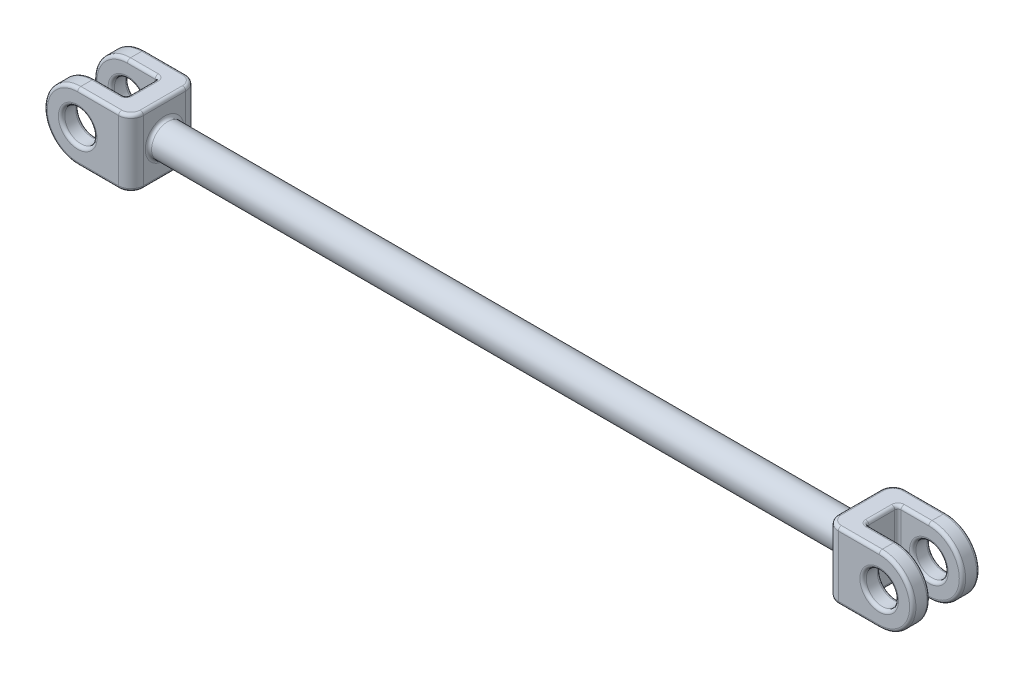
from build123d import *

# Parameters (mm, degrees)
SKETCH1_R          = 4.1275
EXTRUDE1_DEPTH     = 8.5852
SKETCH4_W          = 16.51
SKETCH4_H          = 8.255
CUT_EXTRUDE2_DEPTH = 24.549361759
SKETCH8_R          = 4.1275
EXTRUDE3_DEPTH     = 88.9
FILLET5_R          = 3.175
FILLET6_R          = 0.8128


with BuildPart() as part:
    # Sketch1 → Extrude1 (new, symmetric)
    with BuildSketch(Plane.XY):
        with BuildLine():
            Line((0, -8.5852), (13.6398, -8.5852))
            Line((13.6398, -8.5852), (13.6398, 8.5852))
            Line((13.6398, 8.5852), (0, 8.5852))
            ThreePointArc((0, 8.5852), (-8.5852, 0), (0, -8.5852))
        make_face()
        Circle(SKETCH1_R, mode=Mode.SUBTRACT)
    extrude(amount=EXTRUDE1_DEPTH, both=True)

    # Sketch4 → Cut-Extrude2 (cut, through all)
    with BuildSketch(Plane(origin=(0, 8.5852, 0), x_dir=(-1, 0, 0), z_dir=(0, 1, 0))):
        with Locations((0.3302, 0)):
            Rectangle(SKETCH4_W, SKETCH4_H)
    extrude(amount=-CUT_EXTRUDE2_DEPTH, mode=Mode.SUBTRACT)

    # Sketch8 → Extrude3 (add)
    with BuildSketch(Plane(origin=(13.6398, 0, 0), x_dir=(0, 0, -1), z_dir=(1, 0, 0))):
        with Locations(Location((0, 0, 0), (0, 0, 180))):
            Circle(SKETCH8_R)
    extrude(amount=EXTRUDE3_DEPTH)

    # Mirror1: part across plane


with BuildPart() as part_1:
    add(part.part)
    add(part.part.mirror(Plane(origin=(102.5398, 0, 0), x_dir=(0, 0, 1), z_dir=(1, 0, 0))))

    # Fillet5
    fillet5_edges = [part_1.edges().sort_by_distance(p)[0] for p in [
        (13.6398, 0, 8.5852),
        (13.6398, 0, -8.5852),
        (191.4398, 0, 8.5852),
        (191.4398, 0, -8.5852),
    ]]
    fillet(fillet5_edges, radius=FILLET5_R)

    # Fillet6
    fillet6_edges = [part_1.edges().sort_by_distance(p)[0] for p in [
        (-4.1275, 0, -8.5852),
        (-4.1275, 0, 8.5852),
        (3.9624, 8.5852, 4.1275),
        (7.9248, 8.5852, 0),
        (3.9624, 8.5852, -4.1275),
        (-8.5852, 0, -4.1275),
        (3.9624, -8.5852, -4.1275),
        (-4.1275, 0, -4.1275),
        (-8.5852, 0, 4.1275),
        (3.9624, -8.5852, 4.1275),
        (7.9248, 0, 4.1275),
        (-4.1275, 0, 4.1275),
        (7.9248, -8.5852, 0),
        (7.9248, 0, -4.1275),
        (-8.5852, 0, 8.5852),
        (13.6398, 0, -4.1275),
        (5.2324, -8.5852, -8.5852),
        (191.4398, 0, -4.1275),
        (209.2071, 0, -4.1275),
        (209.2071, 0, -8.5852),
        (209.2071, 0, 8.5852),
        (213.6648, 0, -8.5852),
        (199.8472, -8.5852, -8.5852),
        (213.6648, 0, 8.5852),
        (199.8472, -8.5852, 8.5852),
        (201.1172, 8.5852, 4.1275),
        (197.1548, 8.5852, 0),
        (201.1172, 8.5852, -4.1275),
        (209.2071, 0, 4.1275),
        (213.6648, 0, -4.1275),
        (201.1172, -8.5852, -4.1275),
        (213.6648, 0, 4.1275),
        (201.1172, -8.5852, 4.1275),
        (197.1548, 0, 4.1275),
        (197.1548, -8.5852, 0),
        (197.1548, 0, -4.1275),
        (-8.5852, 0, -8.5852),
        (199.8472, 8.5852, -8.5852),
        (191.4398, 8.5852, 0),
        (5.2324, -8.5852, 8.5852),
        (199.8472, 8.5852, 8.5852),
        (192.36973597, 8.5852, 7.65526403),
        (192.36973597, 8.5852, -7.65526403),
        (191.4398, -8.5852, 0),
        (192.36973597, -8.5852, 7.65526403),
        (192.36973597, -8.5852, -7.65526403),
        (13.6398, 8.5852, 0),
        (13.6398, -8.5852, 0),
        (5.2324, 8.5852, 8.5852),
        (5.2324, 8.5852, -8.5852),
        (12.70986403, 8.5852, 7.65526403),
        (12.70986403, 8.5852, -7.65526403),
        (12.70986403, -8.5852, 7.65526403),
        (12.70986403, -8.5852, -7.65526403),
    ]]
    fillet(fillet6_edges, radius=FILLET6_R)


solid = part_1.part
